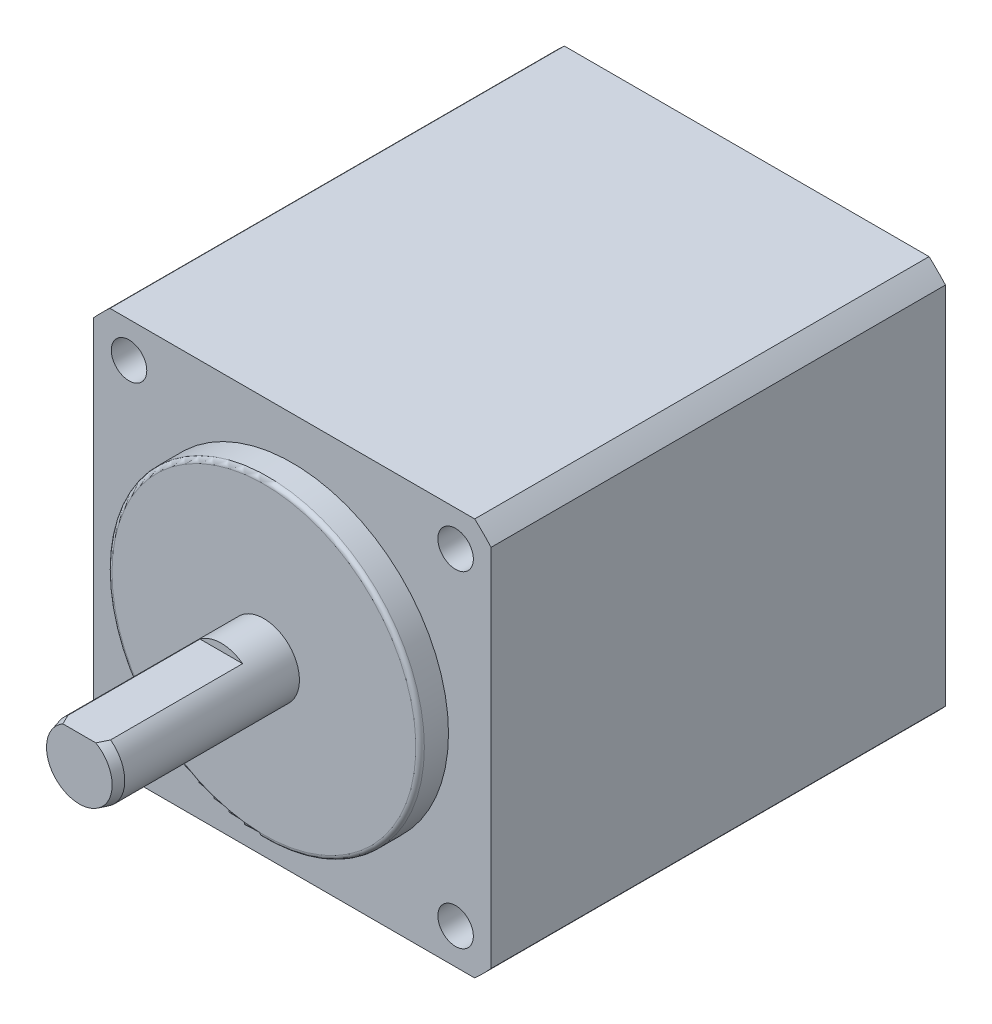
from build123d import *

# Parameters (mm, degrees)
SKETCH1_R      = 2.5
EXTRUDE1_DEPTH = 15
SKETCH2_R      = 11
EXTRUDE2_DEPTH = 2
EXTRUDE3_DEPTH = 32
SKETCH4_W      = 15.2
SKETCH4_H      = 9.5
EXTRUDE4_DEPTH = 5
SKETCH5_W      = 5.160305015
SKETCH5_H      = 2.199474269
EXTRUDE5_DEPTH = 10
CHAMFER1_SIZE  = 0.7
CHAMFER1_SIZE2 = 0.187564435
SKETCH6_R      = 1.25
EXTRUDE6_DEPTH = 4.5
FILLET2_R      = 0.3
EXTRUDE7_START = 10
EXTRUDE7_DEPTH = 10
CHAMFER2_SIZE  = 0.7
CHAMFER2_SIZE2 = 0.187564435


with BuildPart() as part:
    # Sketch1 → Extrude1 (new body)
    with BuildSketch(Plane.XY):
        Circle(SKETCH1_R)
    extrude(amount=EXTRUDE1_DEPTH)

    # Sketch2 → Extrude2 (add)
    with BuildSketch(Plane(origin=(0, 0, 0), x_dir=(-1, 0, 0), z_dir=(0, 0, -1))):
        Circle(SKETCH2_R)
    extrude(amount=-EXTRUDE2_DEPTH)

    # Sketch5 → Extrude5 (cut)
    with BuildSketch(Plane.XY.offset(15)):
        with Locations((0.042297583, 3.099737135)):
            Rectangle(SKETCH5_W, SKETCH5_H)
    extrude(amount=-EXTRUDE5_DEPTH, mode=Mode.SUBTRACT)

    # Chamfer1
    chamfer1_edges = [part.edges().sort_by_distance(p)[0] for p in [
        (-1.118033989, -2.236067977, 15),
    ]]
    chamfer1_side = [part.faces().sort_by_distance(p)[0] for p in [
        (-2.5, 0, 8.5),
    ]]
    chamfer(chamfer1_edges, length=CHAMFER1_SIZE, length2=CHAMFER1_SIZE2, reference=chamfer1_side[0])

    # Fillet2
    fillet2_edges = [part.edges().sort_by_distance(p)[0] for p in [
        (11, 0, 2),
    ]]
    fillet(fillet2_edges, radius=FILLET2_R)


with BuildPart() as body_2:
    # Sketch3 → Extrude3 (new body)
    with BuildSketch(Plane(origin=(0, 0, 0), x_dir=(-1, 0, 0), z_dir=(0, 0, -1))):
        with BuildLine():
            Line((-12.845232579, -14), (12.845232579, -14))
            ThreePointArc((12.845232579, -14), (13.435028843, -13.435028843), (14, -12.845232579))
            Line((14, -12.845232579), (14, 12.845232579))
            ThreePointArc((14, 12.845232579), (13.435028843, 13.435028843), (12.845232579, 14))
            Line((12.845232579, 14), (-12.845232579, 14))
            ThreePointArc((-12.845232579, 14), (-13.435028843, 13.435028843), (-14, 12.845232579))
            Line((-14, 12.845232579), (-14, -12.845232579))
            ThreePointArc((-14, -12.845232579), (-13.435028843, -13.435028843), (-12.845232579, -14))
        make_face()
    extrude(amount=EXTRUDE3_DEPTH)

    # Sketch4 → Extrude4 (add)
    with BuildSketch(Plane.XZ.offset(14)):
        with Locations((0, -27.25)):
            Rectangle(SKETCH4_W, SKETCH4_H)
    extrude(amount=EXTRUDE4_DEPTH)

    # Sketch6 → Extrude6 (cut)
    with BuildSketch(Plane.XY):
        with Locations((-11.5, 11.5)):
            Circle(SKETCH6_R)
        with Locations((11.5, 11.5)):
            Circle(SKETCH6_R)
        with Locations((-11.5, -11.5)):
            Circle(SKETCH6_R)
        with Locations((11.5, -11.5)):
            Circle(SKETCH6_R)
    extrude(amount=-EXTRUDE6_DEPTH, mode=Mode.SUBTRACT)

    # Sketch7 → Extrude7 (add)
    with BuildSketch(Plane(origin=(0, 0, -32), x_dir=(-1, 0, 0), z_dir=(0, 0, -1)).offset(EXTRUDE7_START)):
        with BuildLine():
            Line((1.5, 2), (-1.5, 2))
            ThreePointArc((-1.5, 2), (-1.118033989, -2.236067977), (2.5, 0))
            ThreePointArc((2.5, 0), (2.236067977, 1.118033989), (1.5, 2))
        make_face()
    extrude(amount=-EXTRUDE7_DEPTH)

    # Chamfer2
    chamfer2_edges = [body_2.edges().sort_by_distance(p)[0] for p in [
        (1.118033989, -2.236067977, -42),
    ]]
    chamfer2_side = [body_2.faces().sort_by_distance(p)[0] for p in [
        (1.118033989, -2.236067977, -37),
    ]]
    chamfer(chamfer2_edges, length=CHAMFER2_SIZE, length2=CHAMFER2_SIZE2, reference=chamfer2_side[0])


solid = Compound([part.part, body_2.part])
